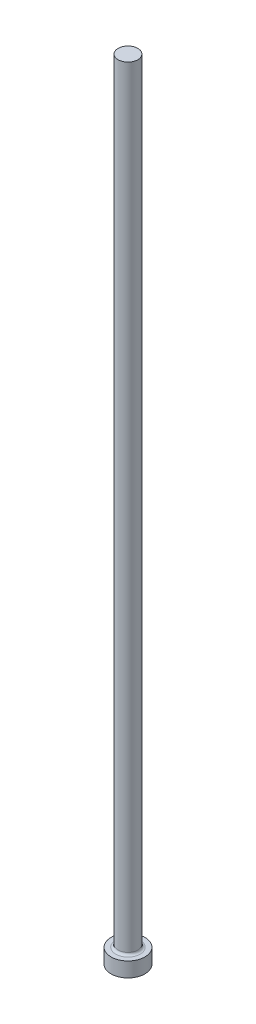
from build123d import *


with BuildPart() as part:
    # Sketch1 → Revolve1 (revolve)
    with BuildSketch(Plane.XY, mode=Mode.PRIVATE) as revolve1_sk:
        with BuildLine():
            Line((0, 0), (5.461, 0))
            Line((5.461, 0), (5.461, 4.7498))
            Line((5.461, 4.7498), (3.937, 4.7498))
            ThreePointArc((3.937, 4.7498), (3.398184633, 4.972984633), (3.175, 5.5118))
            Line((3.175, 5.5118), (3.175, 254))
            Line((3.175, 254), (0, 254))
            Line((0, 254), (0, 0))
        make_face()
    revolve(revolve1_sk.sketch.rotate(Axis((0, 254, 0), (0, -1, 0)), 180), axis=Axis((0, 254, 0), (0, -1, 0)))


solid = part.part
